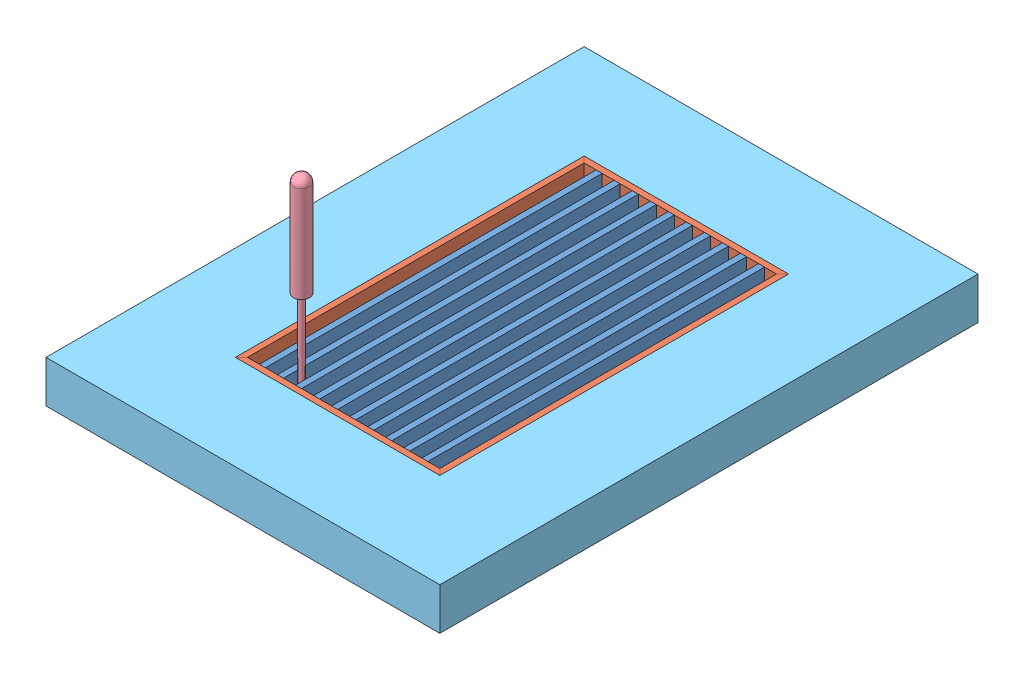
SolidWorks assembly 508.SLDASM, configuration Default (file format 11000). Lengths in mm.
Overall size (107.95 22.23 184.15).
8 component instances, 5 part files, 12 mates.
Components (placement in the parent):
- Standard AG10 Core-1: Standard AG10 Core.SLDPRT [Default] at origin size (101.6 19.05 177.8)
- Standard AG10 A Frame-1: Standard AG10 A Frame.SLDPRT [Default] at (42.8625 -12.7 3.175) x (0 0 -1) z (1 0 0) size (184.15 22.23 107.95)
- Hex Head Screw(Provided)-1: Hex Head Screw(Provided).SLDPRT [Default] at (71.4375 -12.7 -171.45) x (0 0 1) z (-1 0 0) size (5.56 9.52 5.56)
- Hex Head Screw(Provided)-2: Hex Head Screw(Provided).SLDPRT [Default] at (14.2875 -12.7 -171.45) x (0 0 1) z (-1 0 0) size (5.56 9.52 5.56)
- Hex Head Screw(Provided)-3: Hex Head Screw(Provided).SLDPRT [Default] at (14.2875 -12.7 -6.35) x (0 0 -1) z (1 0 0) size (5.56 9.52 5.56)
- Hex Head Screw(Provided)-4: Hex Head Screw(Provided).SLDPRT [Default] at (71.4375 -12.7 -6.35) x (0 0 -1) z (1 0 0) size (5.56 9.52 5.56)
- Hex Head Screw Driver-1: Hex Head Screw Driver.SLDPRT [Default] at (14.2875 -3.175 -6.35) x (0.866025 0 -0.5) z (0.5 0 0.866025) size (8.5 105 8.5) (hidden)
- Wall-1: Wall.SLDPRT [Default] at (42.8625 -12.7 -88.9) x (0 0 -1) z (1 0 0) size (284.15 22.23 207.95) (hidden)
Mates (geometry in assembly coordinates):
- Coincident1: coincident: plane of Standard AG10 Core-1 through (1.5875 -9.525 -177.8) normal (0 -1 0); plane of Standard AG10 A Frame-1 through (96.8375 -9.525 -168.275) normal (0 1 0)
- Coincident2: coincident: plane of Standard AG10 Core-1 through (93.6625 0 0) normal (1 0 0); plane of Standard AG10 A Frame-1 through (93.6625 -12.7 3.175) normal (-1 0 0)
- Coincident3: coincident: plane of Standard AG10 Core-1 through (85.725 0 -177.8) normal (0 0 -1); plane of Standard AG10 A Frame-1 through (96.8375 -9.525 -177.8) normal (0 0 1)
- Concentric1: concentric: cylinder of Standard AG10 Core-1 through (71.4375 -6.35 -171.45) axis (0 -1 0) radius 1.5875; cylinder of Hex Head Screw(Provided)-1 through (71.4375 -3.175 -171.45) axis (0 1 0) radius 2.7781
- Coincident4: coincident: plane of Standard AG10 Core-1 through (0 -6.35 0) normal (0 1 0); plane of Hex Head Screw(Provided)-1 through (71.4375 -6.35 -171.45) normal (0 -1 0)
- Parallel1: parallel: plane of Standard AG10 A Frame-1 through (96.8375 -9.525 -177.8) normal (0 0 1); plane of Hex Head Screw(Provided)-1 through (70.6755 -4.445 -170.1302) normal (0 0 -1)
- Coincident6: coincident: plane of Hex Head Screw(Provided)-3 through (14.2875 -3.175 -6.35) normal (0 1 0); plane of Hex Head Screw Driver-1 through (14.2875 -3.175 -6.35) normal (0 -1 0)
- Concentric2: concentric: cylinder of Hex Head Screw(Provided)-3 through (14.2875 -3.175 -6.35) axis (0 1 0) radius 2.7781; cylinder of Hex Head Screw Driver-1 through (14.2875 46.825 -6.35) axis (0 -1 0) radius 1.524
- Coincident7: coincident: line of Hex Head Screw(Provided)-3 through (15.0495 -3.175 -7.6698) axis (-1 0 0); plane of Hex Head Screw Driver-1 through (13.5255 4.325 -7.6698) normal (0 0 -1)
- Coincident8: coincident: plane of Standard AG10 A Frame-1 through (96.8375 9.525 0) normal (0 1 0); plane of Wall-1 through (42.8625 9.525 -88.9) normal (0 1 0)
- Coincident9: coincident: plane of Standard AG10 A Frame-1 through (96.8375 -12.7 3.175) normal (0 0 1); plane of Wall-1 through (96.8375 9.525 3.175) normal (0 0 -1)
- Coincident10: coincident: plane of Standard AG10 A Frame-1 through (-11.1125 -12.7 3.175) normal (-1 0 0); plane of Wall-1 through (-11.1125 9.525 -180.975) normal (1 0 0)
